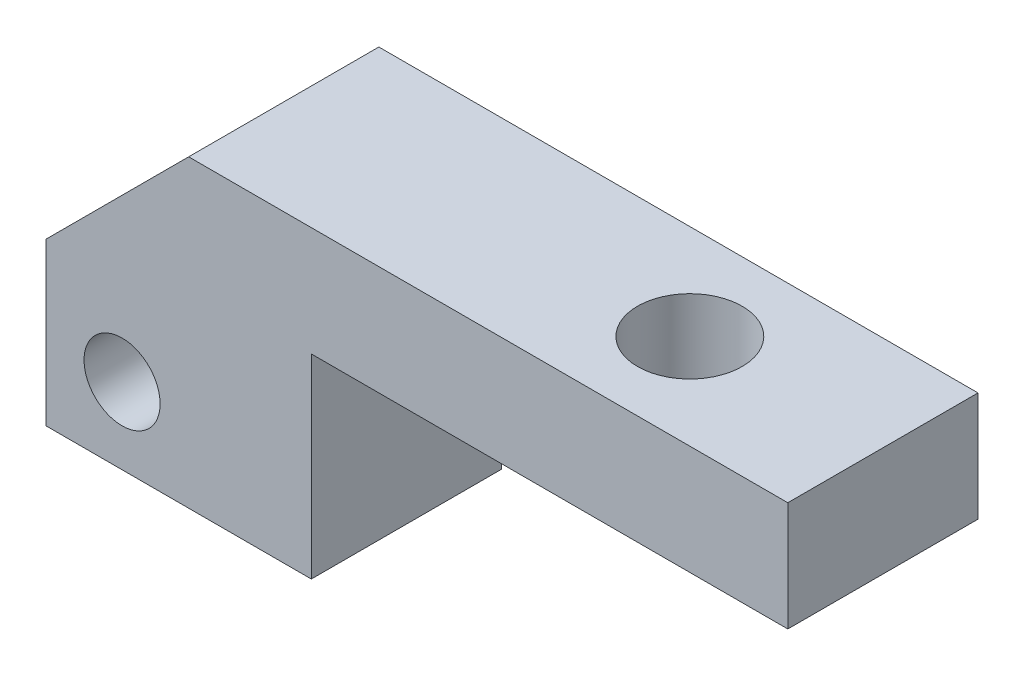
from build123d import *

# Parameters (mm, degrees)
ESQUISSE1_R             = 4
EXTRUSION1_DEPTH        = 10
CHANFREIN1_SIZE         = 15
ENL_V_MAT_EXTRU_1_REACH = 62.283
ESQUISSE2_R             = 5.5


with BuildPart() as part:
    # Esquisse1 → Extrusion1 (new, symmetric)
    with BuildSketch(Plane.XY):
        Polygon((0, 0), (-27.9, 0), (-27.9, 32), (50.1, 32), (50.1, 20.5), (0, 20.5), align=None)
        with Locations((-19.9, 8)):
            Circle(ESQUISSE1_R, mode=Mode.SUBTRACT)
    extrude(amount=EXTRUSION1_DEPTH, both=True)

    # Chanfrein1
    chanfrein1_edges = [part.edges().sort_by_distance(p)[0] for p in [
        (-27.9, 32, 0),
    ]]
    chamfer(chanfrein1_edges, length=CHANFREIN1_SIZE)

    # Esquisse2 → Enl_v. mat.-Extru.1 (cut, up to next)
    with BuildSketch(Plane(origin=(0, 32, 0), x_dir=(-1, 0, 0), z_dir=(0, 1, 0)), mode=Mode.PRIVATE) as enl_v_mat_extru_1_sk1:
        with Locations(Location((-29.8, 0, 0), (0, 0, 90))):
            Circle(ESQUISSE2_R)
    enl_v_mat_extru_1_tool1 = extrude(enl_v_mat_extru_1_sk1.sketch, amount=-ENL_V_MAT_EXTRU_1_REACH, mode=Mode.PRIVATE) & part.part
    add(enl_v_mat_extru_1_tool1.solids().sort_by_distance((29.8, 32, 0))[0], mode=Mode.SUBTRACT)


solid = part.part
